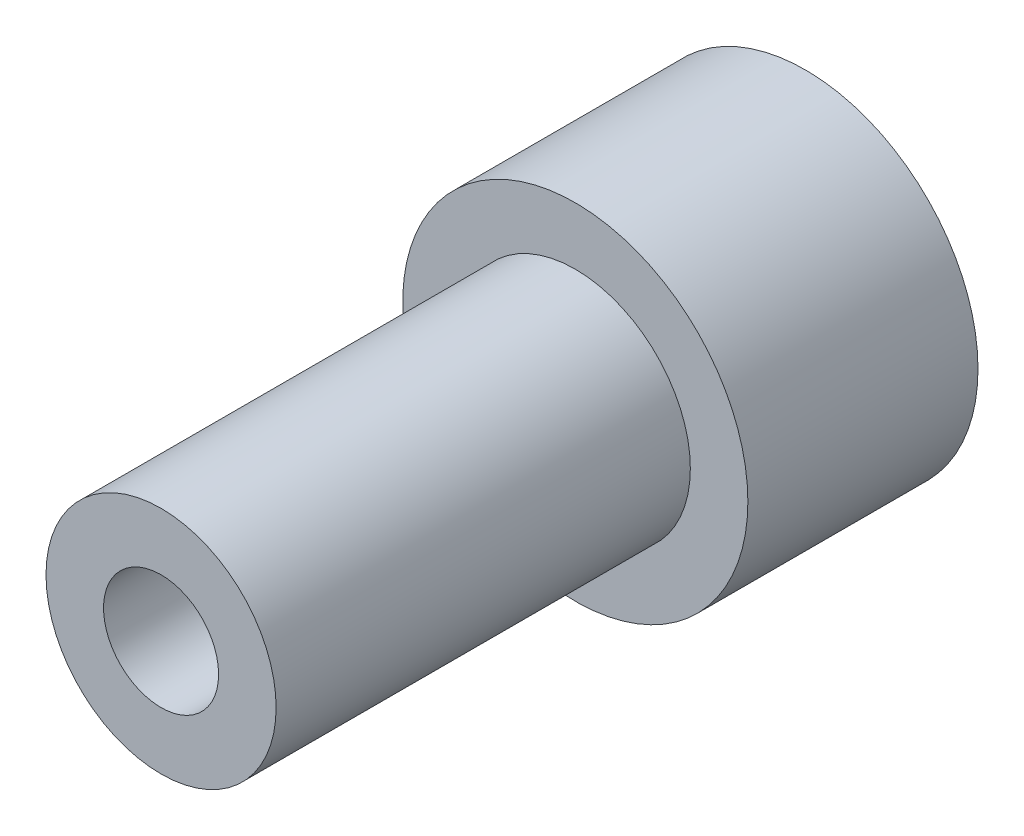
ISO-10303-21;
HEADER;
FILE_DESCRIPTION(('STEP AP214'),'2;1');
FILE_NAME('part.step','',(''),(''),'','','');
FILE_SCHEMA(('AUTOMOTIVE_DESIGN { 1 0 10303 214 1 1 1 1 }'));
ENDSEC;
DATA;
#1=APPLICATION_CONTEXT('core data for automotive mechanical design processes');
#2=APPLICATION_PROTOCOL_DEFINITION('international standard','automotive_design',2000,#1);
#3=PRODUCT_CONTEXT('',#1,'mechanical');
#4=PRODUCT('Part','Part','',(#3));
#5=PRODUCT_RELATED_PRODUCT_CATEGORY('part','',(#4));
#6=PRODUCT_DEFINITION_FORMATION('','',#4);
#7=PRODUCT_DEFINITION_CONTEXT('part definition',#1,'design');
#8=PRODUCT_DEFINITION('design','',#6,#7);
#9=PRODUCT_DEFINITION_SHAPE('','',#8);
#10=(LENGTH_UNIT() NAMED_UNIT(*) SI_UNIT(.MILLI.,.METRE.));
#11=(NAMED_UNIT(*) PLANE_ANGLE_UNIT() SI_UNIT($,.RADIAN.));
#12=(NAMED_UNIT(*) SI_UNIT($,.STERADIAN.) SOLID_ANGLE_UNIT());
#13=UNCERTAINTY_MEASURE_WITH_UNIT(LENGTH_MEASURE(1.E-05),#10,'distance_accuracy_value','');
#14=(GEOMETRIC_REPRESENTATION_CONTEXT(3) GLOBAL_UNCERTAINTY_ASSIGNED_CONTEXT((#13)) GLOBAL_UNIT_ASSIGNED_CONTEXT((#10,
#11,#12)) REPRESENTATION_CONTEXT('',''));
#15=CARTESIAN_POINT('',(0.,0.,0.));
#16=DIRECTION('',(0.,0.,1.));
#17=DIRECTION('',(1.,0.,0.));
#18=AXIS2_PLACEMENT_3D('',#15,#16,#17);
#19=CARTESIAN_POINT('',(0.,0.,0.));
#20=DIRECTION('',(0.,0.,1.));
#21=DIRECTION('',(1.,0.,0.));
#22=AXIS2_PLACEMENT_3D('',#19,#20,#21);
#23=CYLINDRICAL_SURFACE('',#22,1.5875);
#24=CARTESIAN_POINT('',(0.,0.,17.78));
#25=DIRECTION('',(0.,0.,1.));
#26=DIRECTION('',(1.,0.,0.));
#27=AXIS2_PLACEMENT_3D('',#24,#25,#26);
#28=CIRCLE('',#27,1.5875);
#29=CARTESIAN_POINT('',(1.5875,0.,17.78));
#30=VERTEX_POINT('',#29);
#31=EDGE_CURVE('E138',#30,#30,#28,.T.);
#32=ORIENTED_EDGE('',*,*,#31,.T.);
#33=EDGE_LOOP('',(#32));
#34=FACE_BOUND('',#33,.T.);
#35=CARTESIAN_POINT('',(0.,0.,3.683));
#36=DIRECTION('',(0.,0.,-1.));
#37=DIRECTION('',(-1.,0.,0.));
#38=AXIS2_PLACEMENT_3D('',#35,#36,#37);
#39=CIRCLE('',#38,1.5875);
#40=CARTESIAN_POINT('',(-1.5875,0.,3.683));
#41=VERTEX_POINT('',#40);
#42=EDGE_CURVE('E32',#41,#41,#39,.F.);
#43=ORIENTED_EDGE('',*,*,#42,.F.);
#44=EDGE_LOOP('',(#43));
#45=FACE_BOUND('',#44,.T.);
#46=ADVANCED_FACE('F28',(#34,#45),#23,.F.);
#47=CARTESIAN_POINT('',(0.,0.,6.35));
#48=DIRECTION('',(0.,0.,1.));
#49=DIRECTION('',(1.,0.,0.));
#50=AXIS2_PLACEMENT_3D('',#47,#48,#49);
#51=PLANE('',#50);
#52=CARTESIAN_POINT('',(0.,0.,6.35));
#53=DIRECTION('',(0.,0.,1.));
#54=DIRECTION('',(1.,0.,0.));
#55=AXIS2_PLACEMENT_3D('',#52,#53,#54);
#56=CIRCLE('',#55,4.7625);
#57=CARTESIAN_POINT('',(4.7625,0.,6.35));
#58=VERTEX_POINT('',#57);
#59=EDGE_CURVE('E11',#58,#58,#56,.T.);
#60=ORIENTED_EDGE('',*,*,#59,.T.);
#61=EDGE_LOOP('',(#60));
#62=FACE_BOUND('',#61,.T.);
#63=CARTESIAN_POINT('',(0.,0.,6.35));
#64=DIRECTION('',(0.,0.,1.));
#65=DIRECTION('',(1.,0.,0.));
#66=AXIS2_PLACEMENT_3D('',#63,#64,#65);
#67=CIRCLE('',#66,3.175);
#68=CARTESIAN_POINT('',(3.175,0.,6.35));
#69=VERTEX_POINT('',#68);
#70=EDGE_CURVE('E141',#69,#69,#67,.T.);
#71=ORIENTED_EDGE('',*,*,#70,.F.);
#72=EDGE_LOOP('',(#71));
#73=FACE_BOUND('',#72,.T.);
#74=ADVANCED_FACE('F160',(#62,#73),#51,.T.);
#75=CARTESIAN_POINT('',(0.,0.,6.35));
#76=DIRECTION('',(0.,0.,-1.));
#77=DIRECTION('',(-1.,0.,0.));
#78=AXIS2_PLACEMENT_3D('',#75,#76,#77);
#79=CYLINDRICAL_SURFACE('',#78,4.7625);
#80=ORIENTED_EDGE('',*,*,#59,.F.);
#81=EDGE_LOOP('',(#80));
#82=FACE_BOUND('',#81,.T.);
#83=CARTESIAN_POINT('',(0.,0.,0.));
#84=DIRECTION('',(0.,0.,1.));
#85=DIRECTION('',(1.,0.,0.));
#86=AXIS2_PLACEMENT_3D('',#83,#84,#85);
#87=CIRCLE('',#86,4.7625);
#88=CARTESIAN_POINT('',(4.7625,0.,0.));
#89=VERTEX_POINT('',#88);
#90=EDGE_CURVE('E37',#89,#89,#87,.T.);
#91=ORIENTED_EDGE('',*,*,#90,.T.);
#92=EDGE_LOOP('',(#91));
#93=FACE_BOUND('',#92,.T.);
#94=ADVANCED_FACE('F30',(#82,#93),#79,.T.);
#95=CARTESIAN_POINT('',(0.,0.,0.));
#96=DIRECTION('',(0.,0.,1.));
#97=DIRECTION('',(1.,0.,0.));
#98=AXIS2_PLACEMENT_3D('',#95,#96,#97);
#99=PLANE('',#98);
#100=DIRECTION('',(0.866025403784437,-0.500000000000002,0.));
#101=VECTOR('',#100,1.);
#102=CARTESIAN_POINT('',(2.38125,1.3748153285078,0.));
#103=LINE('',#102,#101);
#104=CARTESIAN_POINT('',(0.,2.74963065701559,0.));
#105=VERTEX_POINT('',#104);
#106=CARTESIAN_POINT('',(2.38125,1.3748153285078,0.));
#107=VERTEX_POINT('',#106);
#108=EDGE_CURVE('E98',#105,#107,#103,.T.);
#109=ORIENTED_EDGE('',*,*,#108,.F.);
#110=DIRECTION('',(0.86602540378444,0.499999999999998,0.));
#111=VECTOR('',#110,1.);
#112=CARTESIAN_POINT('',(-2.38125,1.3748153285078,0.));
#113=LINE('',#112,#111);
#114=CARTESIAN_POINT('',(-2.38125,1.3748153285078,0.));
#115=VERTEX_POINT('',#114);
#116=EDGE_CURVE('E44',#115,#105,#113,.T.);
#117=ORIENTED_EDGE('',*,*,#116,.F.);
#118=DIRECTION('',(0.,1.,0.));
#119=VECTOR('',#118,1.);
#120=CARTESIAN_POINT('',(-2.38125,1.3748153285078,0.));
#121=LINE('',#120,#119);
#122=CARTESIAN_POINT('',(-2.38125,-1.3748153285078,0.));
#123=VERTEX_POINT('',#122);
#124=EDGE_CURVE('E114',#123,#115,#121,.T.);
#125=ORIENTED_EDGE('',*,*,#124,.F.);
#126=DIRECTION('',(-0.866025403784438,0.5,0.));
#127=VECTOR('',#126,1.);
#128=CARTESIAN_POINT('',(0.,-2.74963065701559,0.));
#129=LINE('',#128,#127);
#130=CARTESIAN_POINT('',(0.,-2.74963065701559,0.));
#131=VERTEX_POINT('',#130);
#132=EDGE_CURVE('E108',#131,#123,#129,.T.);
#133=ORIENTED_EDGE('',*,*,#132,.F.);
#134=DIRECTION('',(-0.866025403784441,-0.499999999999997,0.));
#135=VECTOR('',#134,1.);
#136=CARTESIAN_POINT('',(2.38125,-1.3748153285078,0.));
#137=LINE('',#136,#135);
#138=CARTESIAN_POINT('',(2.38125,-1.3748153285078,0.));
#139=VERTEX_POINT('',#138);
#140=EDGE_CURVE('E106',#139,#131,#137,.T.);
#141=ORIENTED_EDGE('',*,*,#140,.F.);
#142=DIRECTION('',(0.,-1.,0.));
#143=VECTOR('',#142,1.);
#144=CARTESIAN_POINT('',(2.38125,1.3748153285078,0.));
#145=LINE('',#144,#143);
#146=EDGE_CURVE('E87',#107,#139,#145,.T.);
#147=ORIENTED_EDGE('',*,*,#146,.F.);
#148=EDGE_LOOP('',(#109,#117,#125,#133,#141,#147));
#149=FACE_BOUND('',#148,.T.);
#150=ORIENTED_EDGE('',*,*,#90,.F.);
#151=EDGE_LOOP('',(#150));
#152=FACE_BOUND('',#151,.T.);
#153=ADVANCED_FACE('F102',(#149,#152),#99,.F.);
#154=CARTESIAN_POINT('',(0.,0.,17.78));
#155=DIRECTION('',(0.,0.,-1.));
#156=DIRECTION('',(-1.,0.,0.));
#157=AXIS2_PLACEMENT_3D('',#154,#155,#156);
#158=CYLINDRICAL_SURFACE('',#157,3.175);
#159=CARTESIAN_POINT('',(0.,0.,17.78));
#160=DIRECTION('',(0.,0.,1.));
#161=DIRECTION('',(1.,0.,0.));
#162=AXIS2_PLACEMENT_3D('',#159,#160,#161);
#163=CIRCLE('',#162,3.175);
#164=CARTESIAN_POINT('',(3.175,0.,17.78));
#165=VERTEX_POINT('',#164);
#166=EDGE_CURVE('E144',#165,#165,#163,.T.);
#167=ORIENTED_EDGE('',*,*,#166,.F.);
#168=EDGE_LOOP('',(#167));
#169=FACE_BOUND('',#168,.T.);
#170=ORIENTED_EDGE('',*,*,#70,.T.);
#171=EDGE_LOOP('',(#170));
#172=FACE_BOUND('',#171,.T.);
#173=ADVANCED_FACE('F151',(#169,#172),#158,.T.);
#174=CARTESIAN_POINT('',(0.,0.,17.78));
#175=DIRECTION('',(0.,0.,1.));
#176=DIRECTION('',(1.,0.,0.));
#177=AXIS2_PLACEMENT_3D('',#174,#175,#176);
#178=PLANE('',#177);
#179=ORIENTED_EDGE('',*,*,#31,.F.);
#180=EDGE_LOOP('',(#179));
#181=FACE_BOUND('',#180,.T.);
#182=ORIENTED_EDGE('',*,*,#166,.T.);
#183=EDGE_LOOP('',(#182));
#184=FACE_BOUND('',#183,.T.);
#185=ADVANCED_FACE('F157',(#181,#184),#178,.T.);
#186=CARTESIAN_POINT('',(2.38125,4.12444598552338,3.683));
#187=DIRECTION('',(0.,0.,-1.));
#188=DIRECTION('',(-1.,0.,0.));
#189=AXIS2_PLACEMENT_3D('',#186,#187,#188);
#190=PLANE('',#189);
#191=DIRECTION('',(0.86602540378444,0.499999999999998,0.));
#192=VECTOR('',#191,1.);
#193=CARTESIAN_POINT('',(-2.38125,1.3748153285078,3.683));
#194=LINE('',#193,#192);
#195=CARTESIAN_POINT('',(-2.38125,1.3748153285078,3.683));
#196=VERTEX_POINT('',#195);
#197=CARTESIAN_POINT('',(0.,2.7496306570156,3.683));
#198=VERTEX_POINT('',#197);
#199=EDGE_CURVE('E116',#196,#198,#194,.T.);
#200=ORIENTED_EDGE('',*,*,#199,.T.);
#201=DIRECTION('',(0.866025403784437,-0.500000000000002,0.));
#202=VECTOR('',#201,1.);
#203=CARTESIAN_POINT('',(2.38125,1.3748153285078,3.683));
#204=LINE('',#203,#202);
#205=CARTESIAN_POINT('',(2.38125,1.3748153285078,3.683));
#206=VERTEX_POINT('',#205);
#207=EDGE_CURVE('E119',#198,#206,#204,.T.);
#208=ORIENTED_EDGE('',*,*,#207,.T.);
#209=DIRECTION('',(0.,-1.,0.));
#210=VECTOR('',#209,1.);
#211=CARTESIAN_POINT('',(2.38125,1.3748153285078,3.683));
#212=LINE('',#211,#210);
#213=CARTESIAN_POINT('',(2.38125,-1.3748153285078,3.683));
#214=VERTEX_POINT('',#213);
#215=EDGE_CURVE('E90',#206,#214,#212,.T.);
#216=ORIENTED_EDGE('',*,*,#215,.T.);
#217=DIRECTION('',(-0.866025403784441,-0.499999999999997,0.));
#218=VECTOR('',#217,1.);
#219=CARTESIAN_POINT('',(2.38125,-1.3748153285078,3.683));
#220=LINE('',#219,#218);
#221=CARTESIAN_POINT('',(0.,-2.74963065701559,3.683));
#222=VERTEX_POINT('',#221);
#223=EDGE_CURVE('E122',#214,#222,#220,.T.);
#224=ORIENTED_EDGE('',*,*,#223,.T.);
#225=DIRECTION('',(-0.866025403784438,0.5,0.));
#226=VECTOR('',#225,1.);
#227=CARTESIAN_POINT('',(0.,-2.74963065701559,3.683));
#228=LINE('',#227,#226);
#229=CARTESIAN_POINT('',(-2.38125,-1.3748153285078,3.683));
#230=VERTEX_POINT('',#229);
#231=EDGE_CURVE('E125',#222,#230,#228,.T.);
#232=ORIENTED_EDGE('',*,*,#231,.T.);
#233=DIRECTION('',(0.,1.,0.));
#234=VECTOR('',#233,1.);
#235=CARTESIAN_POINT('',(-2.38125,1.3748153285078,3.683));
#236=LINE('',#235,#234);
#237=EDGE_CURVE('E128',#230,#196,#236,.T.);
#238=ORIENTED_EDGE('',*,*,#237,.T.);
#239=EDGE_LOOP('',(#200,#208,#216,#224,#232,#238));
#240=FACE_BOUND('',#239,.T.);
#241=ORIENTED_EDGE('',*,*,#42,.T.);
#242=EDGE_LOOP('',(#241));
#243=FACE_BOUND('',#242,.T.);
#244=ADVANCED_FACE('F175',(#240,#243),#190,.T.);
#245=CARTESIAN_POINT('',(-2.38125,1.3748153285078,3.683));
#246=DIRECTION('',(-0.499999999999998,0.86602540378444,0.));
#247=DIRECTION('',(-0.86602540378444,-0.499999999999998,0.));
#248=AXIS2_PLACEMENT_3D('',#245,#246,#247);
#249=PLANE('',#248);
#250=ORIENTED_EDGE('',*,*,#116,.T.);
#251=DIRECTION('',(0.,0.,-1.));
#252=VECTOR('',#251,1.);
#253=CARTESIAN_POINT('',(0.,2.7496306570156,3.683));
#254=LINE('',#253,#252);
#255=EDGE_CURVE('E95',#198,#105,#254,.T.);
#256=ORIENTED_EDGE('',*,*,#255,.F.);
#257=ORIENTED_EDGE('',*,*,#199,.F.);
#258=DIRECTION('',(0.,0.,-1.));
#259=VECTOR('',#258,1.);
#260=CARTESIAN_POINT('',(-2.38125,1.3748153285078,3.683));
#261=LINE('',#260,#259);
#262=EDGE_CURVE('E51',#196,#115,#261,.T.);
#263=ORIENTED_EDGE('',*,*,#262,.T.);
#264=EDGE_LOOP('',(#250,#256,#257,#263));
#265=FACE_BOUND('',#264,.T.);
#266=ADVANCED_FACE('F172',(#265),#249,.F.);
#267=CARTESIAN_POINT('',(-2.38125,1.3748153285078,3.683));
#268=DIRECTION('',(-1.,0.,0.));
#269=DIRECTION('',(0.,-1.,0.));
#270=AXIS2_PLACEMENT_3D('',#267,#268,#269);
#271=PLANE('',#270);
#272=ORIENTED_EDGE('',*,*,#124,.T.);
#273=ORIENTED_EDGE('',*,*,#262,.F.);
#274=ORIENTED_EDGE('',*,*,#237,.F.);
#275=DIRECTION('',(0.,0.,-1.));
#276=VECTOR('',#275,1.);
#277=CARTESIAN_POINT('',(-2.38125,-1.3748153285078,3.683));
#278=LINE('',#277,#276);
#279=EDGE_CURVE('E132',#230,#123,#278,.T.);
#280=ORIENTED_EDGE('',*,*,#279,.T.);
#281=EDGE_LOOP('',(#272,#273,#274,#280));
#282=FACE_BOUND('',#281,.T.);
#283=ADVANCED_FACE('F191',(#282),#271,.F.);
#284=CARTESIAN_POINT('',(0.,-2.74963065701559,3.683));
#285=DIRECTION('',(-0.5,-0.866025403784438,0.));
#286=DIRECTION('',(0.866025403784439,-0.5,0.));
#287=AXIS2_PLACEMENT_3D('',#284,#285,#286);
#288=PLANE('',#287);
#289=ORIENTED_EDGE('',*,*,#132,.T.);
#290=ORIENTED_EDGE('',*,*,#279,.F.);
#291=ORIENTED_EDGE('',*,*,#231,.F.);
#292=DIRECTION('',(0.,0.,-1.));
#293=VECTOR('',#292,1.);
#294=CARTESIAN_POINT('',(0.,-2.74963065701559,3.683));
#295=LINE('',#294,#293);
#296=EDGE_CURVE('E134',#222,#131,#295,.T.);
#297=ORIENTED_EDGE('',*,*,#296,.T.);
#298=EDGE_LOOP('',(#289,#290,#291,#297));
#299=FACE_BOUND('',#298,.T.);
#300=ADVANCED_FACE('F196',(#299),#288,.F.);
#301=CARTESIAN_POINT('',(2.38125,-1.3748153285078,3.683));
#302=DIRECTION('',(0.499999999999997,-0.866025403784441,0.));
#303=DIRECTION('',(0.866025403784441,0.499999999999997,0.));
#304=AXIS2_PLACEMENT_3D('',#301,#302,#303);
#305=PLANE('',#304);
#306=ORIENTED_EDGE('',*,*,#140,.T.);
#307=ORIENTED_EDGE('',*,*,#296,.F.);
#308=ORIENTED_EDGE('',*,*,#223,.F.);
#309=DIRECTION('',(0.,0.,-1.));
#310=VECTOR('',#309,1.);
#311=CARTESIAN_POINT('',(2.38125,-1.3748153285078,3.683));
#312=LINE('',#311,#310);
#313=EDGE_CURVE('E94',#214,#139,#312,.T.);
#314=ORIENTED_EDGE('',*,*,#313,.T.);
#315=EDGE_LOOP('',(#306,#307,#308,#314));
#316=FACE_BOUND('',#315,.T.);
#317=ADVANCED_FACE('F199',(#316),#305,.F.);
#318=CARTESIAN_POINT('',(2.38125,1.3748153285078,3.683));
#319=DIRECTION('',(1.,0.,0.));
#320=DIRECTION('',(0.,1.,0.));
#321=AXIS2_PLACEMENT_3D('',#318,#319,#320);
#322=PLANE('',#321);
#323=ORIENTED_EDGE('',*,*,#146,.T.);
#324=ORIENTED_EDGE('',*,*,#313,.F.);
#325=ORIENTED_EDGE('',*,*,#215,.F.);
#326=DIRECTION('',(0.,0.,-1.));
#327=VECTOR('',#326,1.);
#328=CARTESIAN_POINT('',(2.38125,1.3748153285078,3.683));
#329=LINE('',#328,#327);
#330=EDGE_CURVE('E83',#206,#107,#329,.T.);
#331=ORIENTED_EDGE('',*,*,#330,.T.);
#332=EDGE_LOOP('',(#323,#324,#325,#331));
#333=FACE_BOUND('',#332,.T.);
#334=ADVANCED_FACE('F85',(#333),#322,.F.);
#335=CARTESIAN_POINT('',(2.38125,1.3748153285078,3.683));
#336=DIRECTION('',(0.500000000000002,0.866025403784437,0.));
#337=DIRECTION('',(-0.866025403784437,0.500000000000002,0.));
#338=AXIS2_PLACEMENT_3D('',#335,#336,#337);
#339=PLANE('',#338);
#340=ORIENTED_EDGE('',*,*,#108,.T.);
#341=ORIENTED_EDGE('',*,*,#330,.F.);
#342=ORIENTED_EDGE('',*,*,#207,.F.);
#343=ORIENTED_EDGE('',*,*,#255,.T.);
#344=EDGE_LOOP('',(#340,#341,#342,#343));
#345=FACE_BOUND('',#344,.T.);
#346=ADVANCED_FACE('F99',(#345),#339,.F.);
#347=CLOSED_SHELL('',(#46,#74,#94,#153,#173,#185,#244,#266,#283,#300,#317,#334,#346));
#348=MANIFOLD_SOLID_BREP('B2',#347);
#349=ADVANCED_BREP_SHAPE_REPRESENTATION('',(#18,#348),#14);
#350=SHAPE_DEFINITION_REPRESENTATION(#9,#349);
ENDSEC;
END-ISO-10303-21;
